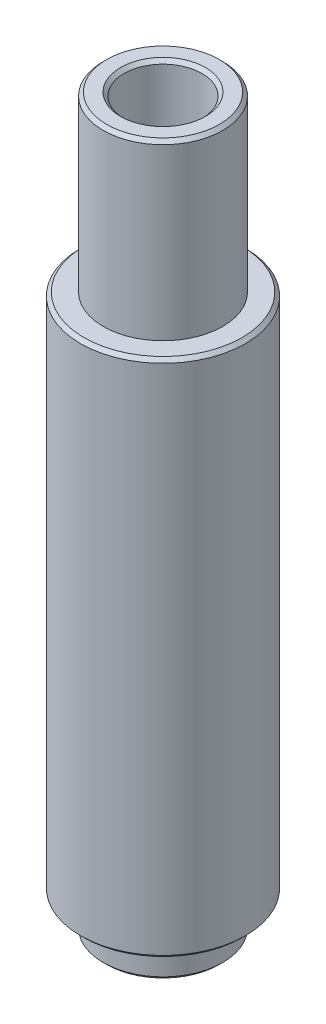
ISO-10303-21;
HEADER;
FILE_DESCRIPTION(('STEP AP214'),'2;1');
FILE_NAME('part.step','',(''),(''),'','','');
FILE_SCHEMA(('AUTOMOTIVE_DESIGN { 1 0 10303 214 1 1 1 1 }'));
ENDSEC;
DATA;
#1=APPLICATION_CONTEXT('core data for automotive mechanical design processes');
#2=APPLICATION_PROTOCOL_DEFINITION('international standard','automotive_design',2000,#1);
#3=PRODUCT_CONTEXT('',#1,'mechanical');
#4=PRODUCT('Part','Part','',(#3));
#5=PRODUCT_RELATED_PRODUCT_CATEGORY('part','',(#4));
#6=PRODUCT_DEFINITION_FORMATION('','',#4);
#7=PRODUCT_DEFINITION_CONTEXT('part definition',#1,'design');
#8=PRODUCT_DEFINITION('design','',#6,#7);
#9=PRODUCT_DEFINITION_SHAPE('','',#8);
#10=(LENGTH_UNIT() NAMED_UNIT(*) SI_UNIT(.MILLI.,.METRE.));
#11=(NAMED_UNIT(*) PLANE_ANGLE_UNIT() SI_UNIT($,.RADIAN.));
#12=(NAMED_UNIT(*) SI_UNIT($,.STERADIAN.) SOLID_ANGLE_UNIT());
#13=UNCERTAINTY_MEASURE_WITH_UNIT(LENGTH_MEASURE(1.E-05),#10,'distance_accuracy_value','');
#14=(GEOMETRIC_REPRESENTATION_CONTEXT(3) GLOBAL_UNCERTAINTY_ASSIGNED_CONTEXT((#13)) GLOBAL_UNIT_ASSIGNED_CONTEXT((#10,
#11,#12)) REPRESENTATION_CONTEXT('',''));
#15=CARTESIAN_POINT('',(0.,0.,0.));
#16=DIRECTION('',(0.,0.,1.));
#17=DIRECTION('',(1.,0.,0.));
#18=AXIS2_PLACEMENT_3D('',#15,#16,#17);
#19=CARTESIAN_POINT('',(3.45,0.,0.));
#20=DIRECTION('',(0.,-1.,0.));
#21=DIRECTION('',(1.,0.,0.));
#22=AXIS2_PLACEMENT_3D('',#19,#20,#21);
#23=PLANE('',#22);
#24=CARTESIAN_POINT('',(0.,0.,0.));
#25=DIRECTION('',(0.,-1.,0.));
#26=DIRECTION('',(1.,0.,0.));
#27=AXIS2_PLACEMENT_3D('',#24,#25,#26);
#28=CIRCLE('',#27,2.4500000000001);
#29=CARTESIAN_POINT('',(2.4500000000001,0.,0.));
#30=VERTEX_POINT('',#29);
#31=EDGE_CURVE('E72',#30,#30,#28,.F.);
#32=ORIENTED_EDGE('',*,*,#31,.T.);
#33=EDGE_LOOP('',(#32));
#34=FACE_BOUND('',#33,.T.);
#35=CARTESIAN_POINT('',(0.,0.,0.));
#36=DIRECTION('',(0.,-1.,0.));
#37=DIRECTION('',(1.,0.,0.));
#38=AXIS2_PLACEMENT_3D('',#35,#36,#37);
#39=CIRCLE('',#38,3.24999999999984);
#40=CARTESIAN_POINT('',(3.24999999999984,0.,0.));
#41=VERTEX_POINT('',#40);
#42=EDGE_CURVE('E75',#41,#41,#39,.T.);
#43=ORIENTED_EDGE('',*,*,#42,.T.);
#44=EDGE_LOOP('',(#43));
#45=FACE_BOUND('',#44,.T.);
#46=ADVANCED_FACE('F39',(#34,#45),#23,.T.);
#47=CARTESIAN_POINT('',(3.43024899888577E-12,-1000.,0.));
#48=DIRECTION('',(0.,-1.,0.));
#49=DIRECTION('',(1.,0.,0.));
#50=AXIS2_PLACEMENT_3D('',#47,#48,#49);
#51=CYLINDRICAL_SURFACE('',#50,2.25000000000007);
#52=CARTESIAN_POINT('',(0.,0.199999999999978,0.));
#53=DIRECTION('',(0.,-1.,0.));
#54=DIRECTION('',(1.,0.,0.));
#55=AXIS2_PLACEMENT_3D('',#52,#53,#54);
#56=CIRCLE('',#55,2.25000000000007);
#57=CARTESIAN_POINT('',(2.25000000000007,0.199999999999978,0.));
#58=VERTEX_POINT('',#57);
#59=EDGE_CURVE('E78',#58,#58,#56,.T.);
#60=CARTESIAN_POINT('',(-1.43384408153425E-13,41.8000000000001,0.));
#61=DIRECTION('',(0.,1.,0.));
#62=DIRECTION('',(-1.,0.,0.));
#63=AXIS2_PLACEMENT_3D('',#60,#61,#62);
#64=CIRCLE('',#63,2.25000000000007);
#65=CARTESIAN_POINT('',(2.24999999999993,41.8000000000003,0.));
#66=VERTEX_POINT('',#65);
#67=EDGE_CURVE('E81',#66,#66,#64,.T.);
#68=CARTESIAN_POINT('',(2.25000000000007,0.199999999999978,0.));
#69=CARTESIAN_POINT('',(2.25000000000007,0.633333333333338,0.));
#70=CARTESIAN_POINT('',(2.25000000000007,1.0666666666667,0.));
#71=CARTESIAN_POINT('',(2.25000000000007,1.93333333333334,0.));
#72=CARTESIAN_POINT('',(2.25000000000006,2.36666666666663,0.));
#73=CARTESIAN_POINT('',(2.25000000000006,3.23333333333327,0.));
#74=CARTESIAN_POINT('',(2.25000000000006,3.66666666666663,0.));
#75=CARTESIAN_POINT('',(2.25000000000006,4.53333333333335,0.));
#76=CARTESIAN_POINT('',(2.25000000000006,4.96666666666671,0.));
#77=CARTESIAN_POINT('',(2.25000000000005,5.83333333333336,0.));
#78=CARTESIAN_POINT('',(2.25000000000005,6.26666666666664,0.));
#79=CARTESIAN_POINT('',(2.25000000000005,7.13333333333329,0.));
#80=CARTESIAN_POINT('',(2.25000000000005,7.56666666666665,0.));
#81=CARTESIAN_POINT('',(2.25000000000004,8.43333333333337,0.));
#82=CARTESIAN_POINT('',(2.25000000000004,8.86666666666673,0.));
#83=CARTESIAN_POINT('',(2.25000000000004,9.73333333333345,0.));
#84=CARTESIAN_POINT('',(2.25000000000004,10.1666666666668,0.));
#85=CARTESIAN_POINT('',(2.25000000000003,11.0333333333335,0.));
#86=CARTESIAN_POINT('',(2.25000000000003,11.4666666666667,0.));
#87=CARTESIAN_POINT('',(2.25000000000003,12.3333333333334,0.));
#88=CARTESIAN_POINT('',(2.25000000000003,12.7666666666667,0.));
#89=CARTESIAN_POINT('',(2.25000000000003,13.6333333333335,0.));
#90=CARTESIAN_POINT('',(2.25000000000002,14.0666666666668,0.));
#91=CARTESIAN_POINT('',(2.25000000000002,14.9333333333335,0.));
#92=CARTESIAN_POINT('',(2.25000000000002,15.3666666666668,0.));
#93=CARTESIAN_POINT('',(2.25000000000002,16.2333333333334,0.));
#94=CARTESIAN_POINT('',(2.25000000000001,16.6666666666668,0.));
#95=CARTESIAN_POINT('',(2.25000000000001,17.5333333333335,0.));
#96=CARTESIAN_POINT('',(2.25000000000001,17.9666666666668,0.));
#97=CARTESIAN_POINT('',(2.25000000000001,18.8333333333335,0.));
#98=CARTESIAN_POINT('',(2.25000000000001,19.2666666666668,0.));
#99=CARTESIAN_POINT('',(2.25,20.1333333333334,0.));
#100=CARTESIAN_POINT('',(2.25,20.5666666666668,0.));
#101=CARTESIAN_POINT('',(2.25,21.4333333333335,0.));
#102=CARTESIAN_POINT('',(2.25,21.8666666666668,0.));
#103=CARTESIAN_POINT('',(2.24999999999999,22.7333333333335,0.));
#104=CARTESIAN_POINT('',(2.24999999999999,23.1666666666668,0.));
#105=CARTESIAN_POINT('',(2.24999999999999,24.0333333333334,0.));
#106=CARTESIAN_POINT('',(2.24999999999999,24.4666666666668,0.));
#107=CARTESIAN_POINT('',(2.24999999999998,25.3333333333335,0.));
#108=CARTESIAN_POINT('',(2.24999999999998,25.7666666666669,0.));
#109=CARTESIAN_POINT('',(2.24999999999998,26.6333333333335,0.));
#110=CARTESIAN_POINT('',(2.24999999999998,27.0666666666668,0.));
#111=CARTESIAN_POINT('',(2.24999999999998,27.9333333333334,0.));
#112=CARTESIAN_POINT('',(2.24999999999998,28.3666666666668,0.));
#113=CARTESIAN_POINT('',(2.24999999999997,29.2333333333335,0.));
#114=CARTESIAN_POINT('',(2.24999999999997,29.6666666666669,0.));
#115=CARTESIAN_POINT('',(2.24999999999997,30.5333333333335,0.));
#116=CARTESIAN_POINT('',(2.24999999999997,30.9666666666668,0.));
#117=CARTESIAN_POINT('',(2.24999999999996,31.8333333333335,0.));
#118=CARTESIAN_POINT('',(2.24999999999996,32.2666666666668,0.));
#119=CARTESIAN_POINT('',(2.24999999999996,33.1333333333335,0.));
#120=CARTESIAN_POINT('',(2.24999999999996,33.5666666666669,0.));
#121=CARTESIAN_POINT('',(2.24999999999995,34.4333333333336,0.));
#122=CARTESIAN_POINT('',(2.24999999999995,34.866666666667,0.));
#123=CARTESIAN_POINT('',(2.24999999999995,35.7333333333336,0.));
#124=CARTESIAN_POINT('',(2.24999999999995,36.1666666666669,0.));
#125=CARTESIAN_POINT('',(2.24999999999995,37.0333333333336,0.));
#126=CARTESIAN_POINT('',(2.24999999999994,37.4666666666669,0.));
#127=CARTESIAN_POINT('',(2.24999999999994,38.3333333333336,0.));
#128=CARTESIAN_POINT('',(2.24999999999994,38.766666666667,0.));
#129=CARTESIAN_POINT('',(2.24999999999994,39.6333333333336,0.));
#130=CARTESIAN_POINT('',(2.24999999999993,40.0666666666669,0.));
#131=CARTESIAN_POINT('',(2.24999999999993,40.9333333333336,0.));
#132=CARTESIAN_POINT('',(2.24999999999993,41.3666666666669,0.));
#133=CARTESIAN_POINT('',(2.24999999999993,41.8000000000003,0.));
#134=B_SPLINE_CURVE_WITH_KNOTS('',3,(#68,#69,#70,#71,#72,#73,#74,#75,#76,#77,#78,#79,#80,#81,
#82,#83,#84,#85,#86,#87,#88,#89,#90,#91,#92,#93,#94,#95,#96,#97,#98,#99,#100,#101,#102,#103,
#104,#105,#106,#107,#108,#109,#110,#111,#112,#113,#114,#115,#116,#117,#118,#119,#120,#121,#122,
#123,#124,#125,#126,#127,#128,#129,#130,#131,#132,#133),.UNSPECIFIED.,.F.,.F.,(4,2,2,2,2,2,2,2,
2,2,2,2,2,2,2,2,2,2,2,2,2,2,2,2,2,2,2,2,2,2,2,2,4),(0.,1.30000000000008,2.59999999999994,
3.90000000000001,5.20000000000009,6.49999999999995,7.80000000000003,9.10000000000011,
10.4000000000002,11.7,13.0000000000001,14.3000000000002,15.6000000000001,16.9000000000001,
18.2000000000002,19.5000000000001,20.8000000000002,22.1000000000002,23.4000000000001,
24.7000000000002,26.0000000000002,27.3000000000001,28.6000000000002,29.9000000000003,
31.2000000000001,32.5000000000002,33.8000000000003,35.1000000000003,36.4000000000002,
37.7000000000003,39.0000000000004,40.3000000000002,41.6000000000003),.UNSPECIFIED.);
#135=EDGE_CURVE('BSEAM109',#58,#66,#134,.T.);
#136=ORIENTED_EDGE('',*,*,#59,.T.);
#137=ORIENTED_EDGE('',*,*,#67,.T.);
#138=ORIENTED_EDGE('',*,*,#135,.T.);
#139=ORIENTED_EDGE('',*,*,#135,.F.);
#140=EDGE_LOOP('',(#136,#138,#137,#139));
#141=FACE_BOUND('',#140,.T.);
#142=ADVANCED_FACE('F109',(#141),#51,.F.);
#143=CARTESIAN_POINT('',(2.25,42.,0.));
#144=DIRECTION('',(0.,1.,0.));
#145=DIRECTION('',(-1.,0.,0.));
#146=AXIS2_PLACEMENT_3D('',#143,#144,#145);
#147=PLANE('',#146);
#148=CARTESIAN_POINT('',(-1.44070457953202E-13,42.,0.));
#149=DIRECTION('',(0.,1.,0.));
#150=DIRECTION('',(-1.,0.,0.));
#151=AXIS2_PLACEMENT_3D('',#148,#149,#150);
#152=CIRCLE('',#151,2.44999999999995);
#153=CARTESIAN_POINT('',(-2.4500000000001,42.,0.));
#154=VERTEX_POINT('',#153);
#155=EDGE_CURVE('E66',#154,#154,#152,.F.);
#156=ORIENTED_EDGE('',*,*,#155,.T.);
#157=EDGE_LOOP('',(#156));
#158=FACE_BOUND('',#157,.T.);
#159=CARTESIAN_POINT('',(-1.44070457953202E-13,42.,0.));
#160=DIRECTION('',(0.,1.,0.));
#161=DIRECTION('',(-1.,0.,0.));
#162=AXIS2_PLACEMENT_3D('',#159,#160,#161);
#163=CIRCLE('',#162,3.25000000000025);
#164=CARTESIAN_POINT('',(3.25000000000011,42.,0.));
#165=VERTEX_POINT('',#164);
#166=EDGE_CURVE('E69',#165,#165,#163,.T.);
#167=ORIENTED_EDGE('',*,*,#166,.T.);
#168=EDGE_LOOP('',(#167));
#169=FACE_BOUND('',#168,.T.);
#170=ADVANCED_FACE('F115',(#158,#169),#147,.T.);
#171=CARTESIAN_POINT('',(3.43024899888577E-12,-1000.,0.));
#172=DIRECTION('',(0.,-1.,0.));
#173=DIRECTION('',(1.,0.,0.));
#174=AXIS2_PLACEMENT_3D('',#171,#172,#173);
#175=CYLINDRICAL_SURFACE('',#174,3.45000000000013);
#176=CARTESIAN_POINT('',(-1.43384408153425E-13,41.8000000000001,0.));
#177=DIRECTION('',(0.,1.,0.));
#178=DIRECTION('',(-1.,0.,0.));
#179=AXIS2_PLACEMENT_3D('',#176,#177,#178);
#180=CIRCLE('',#179,3.45000000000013);
#181=CARTESIAN_POINT('',(3.44999999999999,41.8000000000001,0.));
#182=VERTEX_POINT('',#181);
#183=EDGE_CURVE('E47',#182,#182,#180,.F.);
#184=ORIENTED_EDGE('',*,*,#183,.T.);
#185=EDGE_LOOP('',(#184));
#186=FACE_BOUND('',#185,.T.);
#187=CARTESIAN_POINT('',(-1.09767967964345E-13,32.,0.));
#188=DIRECTION('',(0.,-1.,0.));
#189=DIRECTION('',(1.,0.,0.));
#190=AXIS2_PLACEMENT_3D('',#187,#188,#189);
#191=CIRCLE('',#190,3.45000000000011);
#192=CARTESIAN_POINT('',(3.45,32.,0.));
#193=VERTEX_POINT('',#192);
#194=EDGE_CURVE('E84',#193,#193,#191,.T.);
#195=ORIENTED_EDGE('',*,*,#194,.F.);
#196=EDGE_LOOP('',(#195));
#197=FACE_BOUND('',#196,.T.);
#198=ADVANCED_FACE('F161',(#186,#197),#175,.T.);
#199=CARTESIAN_POINT('',(3.45,32.,0.));
#200=DIRECTION('',(0.,1.,0.));
#201=DIRECTION('',(-1.,0.,0.));
#202=AXIS2_PLACEMENT_3D('',#199,#200,#201);
#203=PLANE('',#202);
#204=CARTESIAN_POINT('',(-1.09767967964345E-13,32.,0.));
#205=DIRECTION('',(0.,1.,0.));
#206=DIRECTION('',(-1.,0.,0.));
#207=AXIS2_PLACEMENT_3D('',#204,#205,#206);
#208=CIRCLE('',#207,4.56250000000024);
#209=CARTESIAN_POINT('',(4.56250000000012,32.,0.));
#210=VERTEX_POINT('',#209);
#211=EDGE_CURVE('E10',#210,#210,#208,.T.);
#212=ORIENTED_EDGE('',*,*,#211,.T.);
#213=EDGE_LOOP('',(#212));
#214=FACE_BOUND('',#213,.T.);
#215=ORIENTED_EDGE('',*,*,#194,.T.);
#216=EDGE_LOOP('',(#215));
#217=FACE_BOUND('',#216,.T.);
#218=ADVANCED_FACE('F105',(#214,#217),#203,.T.);
#219=CARTESIAN_POINT('',(3.43024899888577E-12,-1000.,0.));
#220=DIRECTION('',(0.,-1.,0.));
#221=DIRECTION('',(1.,0.,0.));
#222=AXIS2_PLACEMENT_3D('',#219,#220,#221);
#223=CYLINDRICAL_SURFACE('',#222,4.76250000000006);
#224=CARTESIAN_POINT('',(0.,2.2000000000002,0.));
#225=DIRECTION('',(0.,-1.,0.));
#226=DIRECTION('',(1.,0.,0.));
#227=AXIS2_PLACEMENT_3D('',#224,#225,#226);
#228=CIRCLE('',#227,4.76250000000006);
#229=CARTESIAN_POINT('',(4.76250000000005,2.20000000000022,0.));
#230=VERTEX_POINT('',#229);
#231=EDGE_CURVE('E55',#230,#230,#228,.F.);
#232=ORIENTED_EDGE('',*,*,#231,.T.);
#233=EDGE_LOOP('',(#232));
#234=FACE_BOUND('',#233,.T.);
#235=CARTESIAN_POINT('',(-1.09081918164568E-13,31.8000000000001,0.));
#236=DIRECTION('',(0.,1.,0.));
#237=DIRECTION('',(-1.,0.,0.));
#238=AXIS2_PLACEMENT_3D('',#235,#236,#237);
#239=CIRCLE('',#238,4.76250000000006);
#240=CARTESIAN_POINT('',(4.76249999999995,31.8000000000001,0.));
#241=VERTEX_POINT('',#240);
#242=EDGE_CURVE('E60',#241,#241,#239,.F.);
#243=ORIENTED_EDGE('',*,*,#242,.T.);
#244=EDGE_LOOP('',(#243));
#245=FACE_BOUND('',#244,.T.);
#246=ADVANCED_FACE('F95',(#234,#245),#223,.T.);
#247=CARTESIAN_POINT('',(4.7625,2.,0.));
#248=DIRECTION('',(0.,-1.,0.));
#249=DIRECTION('',(1.,0.,0.));
#250=AXIS2_PLACEMENT_3D('',#247,#248,#249);
#251=PLANE('',#250);
#252=CARTESIAN_POINT('',(0.,1.99999999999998,0.));
#253=DIRECTION('',(0.,-1.,0.));
#254=DIRECTION('',(1.,0.,0.));
#255=AXIS2_PLACEMENT_3D('',#252,#253,#254);
#256=CIRCLE('',#255,4.56249999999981);
#257=CARTESIAN_POINT('',(4.5624999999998,2.,0.));
#258=VERTEX_POINT('',#257);
#259=EDGE_CURVE('E63',#258,#258,#256,.T.);
#260=ORIENTED_EDGE('',*,*,#259,.T.);
#261=EDGE_LOOP('',(#260));
#262=FACE_BOUND('',#261,.T.);
#263=CARTESIAN_POINT('',(0.,2.,0.));
#264=DIRECTION('',(0.,-1.,0.));
#265=DIRECTION('',(1.,0.,0.));
#266=AXIS2_PLACEMENT_3D('',#263,#264,#265);
#267=CIRCLE('',#266,3.45000000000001);
#268=CARTESIAN_POINT('',(3.45,2.00000000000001,0.));
#269=VERTEX_POINT('',#268);
#270=EDGE_CURVE('E87',#269,#269,#267,.T.);
#271=ORIENTED_EDGE('',*,*,#270,.F.);
#272=EDGE_LOOP('',(#271));
#273=FACE_BOUND('',#272,.T.);
#274=ADVANCED_FACE('F93',(#262,#273),#251,.T.);
#275=CARTESIAN_POINT('',(3.43024899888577E-12,-1000.,0.));
#276=DIRECTION('',(0.,-1.,0.));
#277=DIRECTION('',(1.,0.,0.));
#278=AXIS2_PLACEMENT_3D('',#275,#276,#277);
#279=CYLINDRICAL_SURFACE('',#278,3.45);
#280=CARTESIAN_POINT('',(0.,0.2000000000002,0.));
#281=DIRECTION('',(0.,-1.,0.));
#282=DIRECTION('',(1.,0.,0.));
#283=AXIS2_PLACEMENT_3D('',#280,#281,#282);
#284=CIRCLE('',#283,3.45);
#285=CARTESIAN_POINT('',(3.45,0.200000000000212,0.));
#286=VERTEX_POINT('',#285);
#287=EDGE_CURVE('E51',#286,#286,#284,.F.);
#288=ORIENTED_EDGE('',*,*,#287,.T.);
#289=EDGE_LOOP('',(#288));
#290=FACE_BOUND('',#289,.T.);
#291=ORIENTED_EDGE('',*,*,#270,.T.);
#292=EDGE_LOOP('',(#291));
#293=FACE_BOUND('',#292,.T.);
#294=ADVANCED_FACE('F91',(#290,#293),#279,.T.);
#295=CARTESIAN_POINT('',(0.,0.199999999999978,0.));
#296=DIRECTION('',(0.,-1.,0.));
#297=DIRECTION('',(1.,0.,0.));
#298=AXIS2_PLACEMENT_3D('',#295,#296,#297);
#299=CONICAL_SURFACE('',#298,2.25000000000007,0.785398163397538);
#300=CARTESIAN_POINT('',(2.4500000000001,0.,0.));
#301=CARTESIAN_POINT('',(2.44791666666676,0.0020833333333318,0.));
#302=CARTESIAN_POINT('',(2.44583333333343,0.00416666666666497,0.));
#303=CARTESIAN_POINT('',(2.44166666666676,0.00833333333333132,0.));
#304=CARTESIAN_POINT('',(2.43958333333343,0.0104166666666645,0.));
#305=CARTESIAN_POINT('',(2.43541666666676,0.0145833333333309,0.));
#306=CARTESIAN_POINT('',(2.43333333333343,0.0166666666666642,0.));
#307=CARTESIAN_POINT('',(2.42916666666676,0.0208333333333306,0.));
#308=CARTESIAN_POINT('',(2.42708333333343,0.0229166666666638,0.));
#309=CARTESIAN_POINT('',(2.42291666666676,0.0270833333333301,0.));
#310=CARTESIAN_POINT('',(2.42083333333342,0.0291666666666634,0.));
#311=CARTESIAN_POINT('',(2.41666666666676,0.0333333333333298,0.));
#312=CARTESIAN_POINT('',(2.41458333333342,0.0354166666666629,0.));
#313=CARTESIAN_POINT('',(2.41041666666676,0.0395833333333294,0.));
#314=CARTESIAN_POINT('',(2.40833333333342,0.0416666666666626,0.));
#315=CARTESIAN_POINT('',(2.40416666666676,0.045833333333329,0.));
#316=CARTESIAN_POINT('',(2.40208333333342,0.0479166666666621,0.));
#317=CARTESIAN_POINT('',(2.39791666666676,0.0520833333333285,0.));
#318=CARTESIAN_POINT('',(2.39583333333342,0.0541666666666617,0.));
#319=CARTESIAN_POINT('',(2.39166666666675,0.0583333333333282,0.));
#320=CARTESIAN_POINT('',(2.38958333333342,0.0604166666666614,0.));
#321=CARTESIAN_POINT('',(2.38541666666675,0.0645833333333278,0.));
#322=CARTESIAN_POINT('',(2.38333333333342,0.0666666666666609,0.));
#323=CARTESIAN_POINT('',(2.37916666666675,0.0708333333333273,0.));
#324=CARTESIAN_POINT('',(2.37708333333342,0.0729166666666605,0.));
#325=CARTESIAN_POINT('',(2.37291666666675,0.077083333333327,0.));
#326=CARTESIAN_POINT('',(2.37083333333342,0.0791666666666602,0.));
#327=CARTESIAN_POINT('',(2.36666666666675,0.0833333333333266,0.));
#328=CARTESIAN_POINT('',(2.36458333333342,0.0854166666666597,0.));
#329=CARTESIAN_POINT('',(2.36041666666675,0.0895833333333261,0.));
#330=CARTESIAN_POINT('',(2.35833333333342,0.0916666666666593,0.));
#331=CARTESIAN_POINT('',(2.35416666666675,0.0958333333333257,0.));
#332=CARTESIAN_POINT('',(2.35208333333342,0.0979166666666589,0.));
#333=CARTESIAN_POINT('',(2.34791666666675,0.102083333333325,0.));
#334=CARTESIAN_POINT('',(2.34583333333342,0.104166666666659,0.));
#335=CARTESIAN_POINT('',(2.34166666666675,0.108333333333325,0.));
#336=CARTESIAN_POINT('',(2.33958333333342,0.110416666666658,0.));
#337=CARTESIAN_POINT('',(2.33541666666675,0.114583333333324,0.));
#338=CARTESIAN_POINT('',(2.33333333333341,0.116666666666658,0.));
#339=CARTESIAN_POINT('',(2.32916666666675,0.120833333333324,0.));
#340=CARTESIAN_POINT('',(2.32708333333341,0.122916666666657,0.));
#341=CARTESIAN_POINT('',(2.32291666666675,0.127083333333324,0.));
#342=CARTESIAN_POINT('',(2.32083333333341,0.129166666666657,0.));
#343=CARTESIAN_POINT('',(2.31666666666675,0.133333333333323,0.));
#344=CARTESIAN_POINT('',(2.31458333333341,0.135416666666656,0.));
#345=CARTESIAN_POINT('',(2.31041666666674,0.139583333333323,0.));
#346=CARTESIAN_POINT('',(2.30833333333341,0.141666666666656,0.));
#347=CARTESIAN_POINT('',(2.30416666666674,0.145833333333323,0.));
#348=CARTESIAN_POINT('',(2.30208333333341,0.147916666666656,0.));
#349=CARTESIAN_POINT('',(2.29791666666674,0.152083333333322,0.));
#350=CARTESIAN_POINT('',(2.29583333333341,0.154166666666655,0.));
#351=CARTESIAN_POINT('',(2.29166666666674,0.158333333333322,0.));
#352=CARTESIAN_POINT('',(2.28958333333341,0.160416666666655,0.));
#353=CARTESIAN_POINT('',(2.28541666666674,0.164583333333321,0.));
#354=CARTESIAN_POINT('',(2.28333333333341,0.166666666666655,0.));
#355=CARTESIAN_POINT('',(2.27916666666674,0.170833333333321,0.));
#356=CARTESIAN_POINT('',(2.27708333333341,0.172916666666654,0.));
#357=CARTESIAN_POINT('',(2.27291666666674,0.17708333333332,0.));
#358=CARTESIAN_POINT('',(2.27083333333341,0.179166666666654,0.));
#359=CARTESIAN_POINT('',(2.26666666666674,0.18333333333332,0.));
#360=CARTESIAN_POINT('',(2.26458333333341,0.185416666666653,0.));
#361=CARTESIAN_POINT('',(2.26041666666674,0.18958333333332,0.));
#362=CARTESIAN_POINT('',(2.25833333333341,0.191666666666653,0.));
#363=CARTESIAN_POINT('',(2.25416666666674,0.195833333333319,0.));
#364=CARTESIAN_POINT('',(2.2520833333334,0.197916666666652,0.));
#365=CARTESIAN_POINT('',(2.25000000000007,0.199999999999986,0.));
#366=B_SPLINE_CURVE_WITH_KNOTS('',3,(#300,#301,#302,#303,#304,#305,#306,#307,#308,#309,#310,
#311,#312,#313,#314,#315,#316,#317,#318,#319,#320,#321,#322,#323,#324,#325,#326,#327,#328,#329,
#330,#331,#332,#333,#334,#335,#336,#337,#338,#339,#340,#341,#342,#343,#344,#345,#346,#347,#348,
#349,#350,#351,#352,#353,#354,#355,#356,#357,#358,#359,#360,#361,#362,#363,#364,#365),
.UNSPECIFIED.,.F.,.F.,(4,2,2,2,2,2,2,2,2,2,2,2,2,2,2,2,2,2,2,2,2,2,2,2,2,2,2,2,2,2,2,2,4),(0.,
0.00883883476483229,0.0176776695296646,0.0265165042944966,0.0353553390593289,0.0441941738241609,
0.0530330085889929,0.0618718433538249,0.0707106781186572,0.0795495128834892,0.0883883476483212,
0.0972271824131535,0.106066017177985,0.114904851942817,0.12374368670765,0.132582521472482,
0.141421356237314,0.150260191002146,0.159099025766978,0.16793786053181,0.176776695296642,
0.185615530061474,0.194454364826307,0.203293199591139,0.212132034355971,0.220970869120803,
0.229809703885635,0.238648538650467,0.247487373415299,0.256326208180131,0.265165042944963,
0.274003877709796,0.282842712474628),.UNSPECIFIED.);
#367=EDGE_CURVE('BSEAM102',#30,#58,#366,.T.);
#368=ORIENTED_EDGE('',*,*,#31,.F.);
#369=ORIENTED_EDGE('',*,*,#59,.F.);
#370=ORIENTED_EDGE('',*,*,#367,.T.);
#371=ORIENTED_EDGE('',*,*,#367,.F.);
#372=EDGE_LOOP('',(#368,#370,#369,#371));
#373=FACE_BOUND('',#372,.T.);
#374=ADVANCED_FACE('F102',(#373),#299,.F.);
#375=CARTESIAN_POINT('',(-1.44070457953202E-13,42.,0.));
#376=DIRECTION('',(0.,1.,0.));
#377=DIRECTION('',(-1.,0.,0.));
#378=AXIS2_PLACEMENT_3D('',#375,#376,#377);
#379=CONICAL_SURFACE('',#378,2.45,0.785398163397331);
#380=ORIENTED_EDGE('',*,*,#67,.F.);
#381=EDGE_LOOP('',(#380));
#382=FACE_BOUND('',#381,.T.);
#383=ORIENTED_EDGE('',*,*,#155,.F.);
#384=EDGE_LOOP('',(#383));
#385=FACE_BOUND('',#384,.T.);
#386=ADVANCED_FACE('F127',(#382,#385),#379,.F.);
#387=CARTESIAN_POINT('',(0.,2.,0.));
#388=DIRECTION('',(0.,1.,0.));
#389=DIRECTION('',(-1.,0.,0.));
#390=AXIS2_PLACEMENT_3D('',#387,#388,#389);
#391=CONICAL_SURFACE('',#390,4.56249999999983,0.785398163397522);
#392=ORIENTED_EDGE('',*,*,#231,.F.);
#393=EDGE_LOOP('',(#392));
#394=FACE_BOUND('',#393,.T.);
#395=ORIENTED_EDGE('',*,*,#259,.F.);
#396=EDGE_LOOP('',(#395));
#397=FACE_BOUND('',#396,.T.);
#398=ADVANCED_FACE('F134',(#394,#397),#391,.T.);
#399=CARTESIAN_POINT('',(0.,0.,0.));
#400=DIRECTION('',(0.,1.,0.));
#401=DIRECTION('',(-1.,0.,0.));
#402=AXIS2_PLACEMENT_3D('',#399,#400,#401);
#403=CONICAL_SURFACE('',#402,3.24999999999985,0.785398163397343);
#404=ORIENTED_EDGE('',*,*,#287,.F.);
#405=EDGE_LOOP('',(#404));
#406=FACE_BOUND('',#405,.T.);
#407=ORIENTED_EDGE('',*,*,#42,.F.);
#408=EDGE_LOOP('',(#407));
#409=FACE_BOUND('',#408,.T.);
#410=ADVANCED_FACE('F141',(#406,#409),#403,.T.);
#411=CARTESIAN_POINT('',(-1.43384408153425E-13,41.8000000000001,0.));
#412=DIRECTION('',(0.,-1.,0.));
#413=DIRECTION('',(1.,0.,0.));
#414=AXIS2_PLACEMENT_3D('',#411,#412,#413);
#415=CONICAL_SURFACE('',#414,3.45000000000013,0.785398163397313);
#416=CARTESIAN_POINT('',(3.25000000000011,42.,0.));
#417=CARTESIAN_POINT('',(3.25208333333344,41.9979166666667,0.));
#418=CARTESIAN_POINT('',(3.25416666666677,41.9958333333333,0.));
#419=CARTESIAN_POINT('',(3.25833333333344,41.9916666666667,0.));
#420=CARTESIAN_POINT('',(3.26041666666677,41.9895833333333,0.));
#421=CARTESIAN_POINT('',(3.26458333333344,41.9854166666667,0.));
#422=CARTESIAN_POINT('',(3.26666666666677,41.9833333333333,0.));
#423=CARTESIAN_POINT('',(3.27083333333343,41.9791666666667,0.));
#424=CARTESIAN_POINT('',(3.27291666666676,41.9770833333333,0.));
#425=CARTESIAN_POINT('',(3.27708333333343,41.9729166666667,0.));
#426=CARTESIAN_POINT('',(3.27916666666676,41.9708333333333,0.));
#427=CARTESIAN_POINT('',(3.28333333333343,41.9666666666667,0.));
#428=CARTESIAN_POINT('',(3.28541666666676,41.9645833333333,0.));
#429=CARTESIAN_POINT('',(3.28958333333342,41.9604166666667,0.));
#430=CARTESIAN_POINT('',(3.29166666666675,41.9583333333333,0.));
#431=CARTESIAN_POINT('',(3.29583333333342,41.9541666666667,0.));
#432=CARTESIAN_POINT('',(3.29791666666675,41.9520833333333,0.));
#433=CARTESIAN_POINT('',(3.30208333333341,41.9479166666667,0.));
#434=CARTESIAN_POINT('',(3.30416666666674,41.9458333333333,0.));
#435=CARTESIAN_POINT('',(3.30833333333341,41.9416666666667,0.));
#436=CARTESIAN_POINT('',(3.31041666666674,41.9395833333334,0.));
#437=CARTESIAN_POINT('',(3.31458333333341,41.9354166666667,0.));
#438=CARTESIAN_POINT('',(3.31666666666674,41.9333333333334,0.));
#439=CARTESIAN_POINT('',(3.3208333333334,41.9291666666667,0.));
#440=CARTESIAN_POINT('',(3.32291666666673,41.9270833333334,0.));
#441=CARTESIAN_POINT('',(3.3270833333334,41.9229166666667,0.));
#442=CARTESIAN_POINT('',(3.32916666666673,41.9208333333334,0.));
#443=CARTESIAN_POINT('',(3.33333333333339,41.9166666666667,0.));
#444=CARTESIAN_POINT('',(3.33541666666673,41.9145833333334,0.));
#445=CARTESIAN_POINT('',(3.33958333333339,41.9104166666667,0.));
#446=CARTESIAN_POINT('',(3.34166666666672,41.9083333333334,0.));
#447=CARTESIAN_POINT('',(3.34583333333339,41.9041666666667,0.));
#448=CARTESIAN_POINT('',(3.34791666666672,41.9020833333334,0.));
#449=CARTESIAN_POINT('',(3.35208333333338,41.8979166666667,0.));
#450=CARTESIAN_POINT('',(3.35416666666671,41.8958333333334,0.));
#451=CARTESIAN_POINT('',(3.35833333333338,41.8916666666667,0.));
#452=CARTESIAN_POINT('',(3.36041666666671,41.8895833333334,0.));
#453=CARTESIAN_POINT('',(3.36458333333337,41.8854166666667,0.));
#454=CARTESIAN_POINT('',(3.36666666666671,41.8833333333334,0.));
#455=CARTESIAN_POINT('',(3.37083333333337,41.8791666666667,0.));
#456=CARTESIAN_POINT('',(3.3729166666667,41.8770833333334,0.));
#457=CARTESIAN_POINT('',(3.37708333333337,41.8729166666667,0.));
#458=CARTESIAN_POINT('',(3.3791666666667,41.8708333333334,0.));
#459=CARTESIAN_POINT('',(3.38333333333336,41.8666666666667,0.));
#460=CARTESIAN_POINT('',(3.38541666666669,41.8645833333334,0.));
#461=CARTESIAN_POINT('',(3.38958333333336,41.8604166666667,0.));
#462=CARTESIAN_POINT('',(3.39166666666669,41.8583333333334,0.));
#463=CARTESIAN_POINT('',(3.39583333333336,41.8541666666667,0.));
#464=CARTESIAN_POINT('',(3.39791666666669,41.8520833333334,0.));
#465=CARTESIAN_POINT('',(3.40208333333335,41.8479166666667,0.));
#466=CARTESIAN_POINT('',(3.40416666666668,41.8458333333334,0.));
#467=CARTESIAN_POINT('',(3.40833333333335,41.8416666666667,0.));
#468=CARTESIAN_POINT('',(3.41041666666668,41.8395833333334,0.));
#469=CARTESIAN_POINT('',(3.41458333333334,41.8354166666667,0.));
#470=CARTESIAN_POINT('',(3.41666666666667,41.8333333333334,0.));
#471=CARTESIAN_POINT('',(3.42083333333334,41.8291666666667,0.));
#472=CARTESIAN_POINT('',(3.42291666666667,41.8270833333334,0.));
#473=CARTESIAN_POINT('',(3.42708333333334,41.8229166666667,0.));
#474=CARTESIAN_POINT('',(3.42916666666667,41.8208333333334,0.));
#475=CARTESIAN_POINT('',(3.43333333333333,41.8166666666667,0.));
#476=CARTESIAN_POINT('',(3.43541666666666,41.8145833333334,0.));
#477=CARTESIAN_POINT('',(3.43958333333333,41.8104166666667,0.));
#478=CARTESIAN_POINT('',(3.44166666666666,41.8083333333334,0.));
#479=CARTESIAN_POINT('',(3.44583333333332,41.8041666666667,0.));
#480=CARTESIAN_POINT('',(3.44791666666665,41.8020833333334,0.));
#481=CARTESIAN_POINT('',(3.44999999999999,41.8000000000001,0.));
#482=B_SPLINE_CURVE_WITH_KNOTS('',3,(#416,#417,#418,#419,#420,#421,#422,#423,#424,#425,#426,
#427,#428,#429,#430,#431,#432,#433,#434,#435,#436,#437,#438,#439,#440,#441,#442,#443,#444,#445,
#446,#447,#448,#449,#450,#451,#452,#453,#454,#455,#456,#457,#458,#459,#460,#461,#462,#463,#464,
#465,#466,#467,#468,#469,#470,#471,#472,#473,#474,#475,#476,#477,#478,#479,#480,#481),
.UNSPECIFIED.,.F.,.F.,(4,2,2,2,2,2,2,2,2,2,2,2,2,2,2,2,2,2,2,2,2,2,2,2,2,2,2,2,2,2,2,2,4),(0.,
0.00883883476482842,0.0176776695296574,0.0265165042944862,0.0353553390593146,0.0441941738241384,
0.0530330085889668,0.0618718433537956,0.0707106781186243,0.0795495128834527,0.0883883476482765,
0.0972271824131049,0.106066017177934,0.114904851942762,0.123743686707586,0.132582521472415,
0.141421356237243,0.150260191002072,0.1590990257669,0.167937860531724,0.176776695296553,
0.185615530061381,0.19445436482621,0.203293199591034,0.212132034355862,0.220970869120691,
0.229809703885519,0.238648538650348,0.247487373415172,0.25632620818,0.265165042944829,
0.274003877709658,0.282842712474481),.UNSPECIFIED.);
#483=EDGE_CURVE('BSEAM147',#165,#182,#482,.T.);
#484=ORIENTED_EDGE('',*,*,#166,.F.);
#485=ORIENTED_EDGE('',*,*,#183,.F.);
#486=ORIENTED_EDGE('',*,*,#483,.T.);
#487=ORIENTED_EDGE('',*,*,#483,.F.);
#488=EDGE_LOOP('',(#484,#486,#485,#487));
#489=FACE_BOUND('',#488,.T.);
#490=ADVANCED_FACE('F147',(#489),#415,.T.);
#491=CARTESIAN_POINT('',(-1.09081918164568E-13,31.8000000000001,0.));
#492=DIRECTION('',(0.,-1.,0.));
#493=DIRECTION('',(1.,0.,0.));
#494=AXIS2_PLACEMENT_3D('',#491,#492,#493);
#495=CONICAL_SURFACE('',#494,4.76250000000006,0.785398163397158);
#496=CARTESIAN_POINT('',(4.56250000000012,32.,0.));
#497=CARTESIAN_POINT('',(4.56458333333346,31.9979166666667,0.));
#498=CARTESIAN_POINT('',(4.56666666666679,31.9958333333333,0.));
#499=CARTESIAN_POINT('',(4.57083333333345,31.9916666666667,0.));
#500=CARTESIAN_POINT('',(4.57291666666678,31.9895833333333,0.));
#501=CARTESIAN_POINT('',(4.57708333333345,31.9854166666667,0.));
#502=CARTESIAN_POINT('',(4.57916666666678,31.9833333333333,0.));
#503=CARTESIAN_POINT('',(4.58333333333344,31.9791666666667,0.));
#504=CARTESIAN_POINT('',(4.58541666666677,31.9770833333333,0.));
#505=CARTESIAN_POINT('',(4.58958333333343,31.9729166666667,0.));
#506=CARTESIAN_POINT('',(4.59166666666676,31.9708333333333,0.));
#507=CARTESIAN_POINT('',(4.59583333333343,31.9666666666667,0.));
#508=CARTESIAN_POINT('',(4.59791666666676,31.9645833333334,0.));
#509=CARTESIAN_POINT('',(4.60208333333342,31.9604166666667,0.));
#510=CARTESIAN_POINT('',(4.60416666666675,31.9583333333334,0.));
#511=CARTESIAN_POINT('',(4.60833333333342,31.9541666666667,0.));
#512=CARTESIAN_POINT('',(4.61041666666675,31.9520833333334,0.));
#513=CARTESIAN_POINT('',(4.61458333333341,31.9479166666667,0.));
#514=CARTESIAN_POINT('',(4.61666666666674,31.9458333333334,0.));
#515=CARTESIAN_POINT('',(4.62083333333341,31.9416666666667,0.));
#516=CARTESIAN_POINT('',(4.62291666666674,31.9395833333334,0.));
#517=CARTESIAN_POINT('',(4.6270833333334,31.9354166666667,0.));
#518=CARTESIAN_POINT('',(4.62916666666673,31.9333333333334,0.));
#519=CARTESIAN_POINT('',(4.6333333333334,31.9291666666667,0.));
#520=CARTESIAN_POINT('',(4.63541666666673,31.9270833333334,0.));
#521=CARTESIAN_POINT('',(4.63958333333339,31.9229166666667,0.));
#522=CARTESIAN_POINT('',(4.64166666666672,31.9208333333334,0.));
#523=CARTESIAN_POINT('',(4.64583333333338,31.9166666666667,0.));
#524=CARTESIAN_POINT('',(4.64791666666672,31.9145833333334,0.));
#525=CARTESIAN_POINT('',(4.65208333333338,31.9104166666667,0.));
#526=CARTESIAN_POINT('',(4.65416666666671,31.9083333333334,0.));
#527=CARTESIAN_POINT('',(4.65833333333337,31.9041666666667,0.));
#528=CARTESIAN_POINT('',(4.6604166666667,31.9020833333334,0.));
#529=CARTESIAN_POINT('',(4.66458333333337,31.8979166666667,0.));
#530=CARTESIAN_POINT('',(4.6666666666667,31.8958333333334,0.));
#531=CARTESIAN_POINT('',(4.67083333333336,31.8916666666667,0.));
#532=CARTESIAN_POINT('',(4.67291666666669,31.8895833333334,0.));
#533=CARTESIAN_POINT('',(4.67708333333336,31.8854166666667,0.));
#534=CARTESIAN_POINT('',(4.67916666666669,31.8833333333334,0.));
#535=CARTESIAN_POINT('',(4.68333333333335,31.8791666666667,0.));
#536=CARTESIAN_POINT('',(4.68541666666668,31.8770833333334,0.));
#537=CARTESIAN_POINT('',(4.68958333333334,31.8729166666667,0.));
#538=CARTESIAN_POINT('',(4.69166666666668,31.8708333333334,0.));
#539=CARTESIAN_POINT('',(4.69583333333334,31.8666666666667,0.));
#540=CARTESIAN_POINT('',(4.69791666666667,31.8645833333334,0.));
#541=CARTESIAN_POINT('',(4.70208333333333,31.8604166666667,0.));
#542=CARTESIAN_POINT('',(4.70416666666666,31.8583333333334,0.));
#543=CARTESIAN_POINT('',(4.70833333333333,31.8541666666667,0.));
#544=CARTESIAN_POINT('',(4.71041666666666,31.8520833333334,0.));
#545=CARTESIAN_POINT('',(4.71458333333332,31.8479166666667,0.));
#546=CARTESIAN_POINT('',(4.71666666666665,31.8458333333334,0.));
#547=CARTESIAN_POINT('',(4.72083333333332,31.8416666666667,0.));
#548=CARTESIAN_POINT('',(4.72291666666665,31.8395833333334,0.));
#549=CARTESIAN_POINT('',(4.72708333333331,31.8354166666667,0.));
#550=CARTESIAN_POINT('',(4.72916666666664,31.8333333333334,0.));
#551=CARTESIAN_POINT('',(4.73333333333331,31.8291666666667,0.));
#552=CARTESIAN_POINT('',(4.73541666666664,31.8270833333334,0.));
#553=CARTESIAN_POINT('',(4.7395833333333,31.8229166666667,0.));
#554=CARTESIAN_POINT('',(4.74166666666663,31.8208333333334,0.));
#555=CARTESIAN_POINT('',(4.74583333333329,31.8166666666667,0.));
#556=CARTESIAN_POINT('',(4.74791666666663,31.8145833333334,0.));
#557=CARTESIAN_POINT('',(4.75208333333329,31.8104166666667,0.));
#558=CARTESIAN_POINT('',(4.75416666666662,31.8083333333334,0.));
#559=CARTESIAN_POINT('',(4.75833333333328,31.8041666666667,0.));
#560=CARTESIAN_POINT('',(4.76041666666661,31.8020833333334,0.));
#561=CARTESIAN_POINT('',(4.76249999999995,31.8000000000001,0.));
#562=B_SPLINE_CURVE_WITH_KNOTS('',3,(#496,#497,#498,#499,#500,#501,#502,#503,#504,#505,#506,
#507,#508,#509,#510,#511,#512,#513,#514,#515,#516,#517,#518,#519,#520,#521,#522,#523,#524,#525,
#526,#527,#528,#529,#530,#531,#532,#533,#534,#535,#536,#537,#538,#539,#540,#541,#542,#543,#544,
#545,#546,#547,#548,#549,#550,#551,#552,#553,#554,#555,#556,#557,#558,#559,#560,#561),
.UNSPECIFIED.,.F.,.F.,(4,2,2,2,2,2,2,2,2,2,2,2,2,2,2,2,2,2,2,2,2,2,2,2,2,2,2,2,2,2,2,2,4),(0.,
0.00883883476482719,0.017677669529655,0.0265165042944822,0.0353553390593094,0.0441941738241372,
0.0530330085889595,0.0618718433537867,0.0707106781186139,0.0795495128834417,0.0883883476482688,
0.0972271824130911,0.10606601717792,0.114904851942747,0.123743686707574,0.132582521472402,
0.141421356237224,0.150260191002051,0.159099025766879,0.167937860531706,0.176776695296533,
0.185615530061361,0.194454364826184,0.203293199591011,0.212132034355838,0.220970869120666,
0.229809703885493,0.238648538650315,0.247487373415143,0.25632620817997,0.265165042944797,
0.274003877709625,0.282842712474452),.UNSPECIFIED.);
#563=EDGE_CURVE('BSEAM42',#210,#241,#562,.T.);
#564=ORIENTED_EDGE('',*,*,#211,.F.);
#565=ORIENTED_EDGE('',*,*,#242,.F.);
#566=ORIENTED_EDGE('',*,*,#563,.T.);
#567=ORIENTED_EDGE('',*,*,#563,.F.);
#568=EDGE_LOOP('',(#564,#566,#565,#567));
#569=FACE_BOUND('',#568,.T.);
#570=ADVANCED_FACE('F42',(#569),#495,.T.);
#571=CLOSED_SHELL('',(#46,#142,#170,#198,#218,#246,#274,#294,#374,#386,#398,#410,#490,#570));
#572=MANIFOLD_SOLID_BREP('B2',#571);
#573=ADVANCED_BREP_SHAPE_REPRESENTATION('',(#18,#572),#14);
#574=SHAPE_DEFINITION_REPRESENTATION(#9,#573);
ENDSEC;
END-ISO-10303-21;
